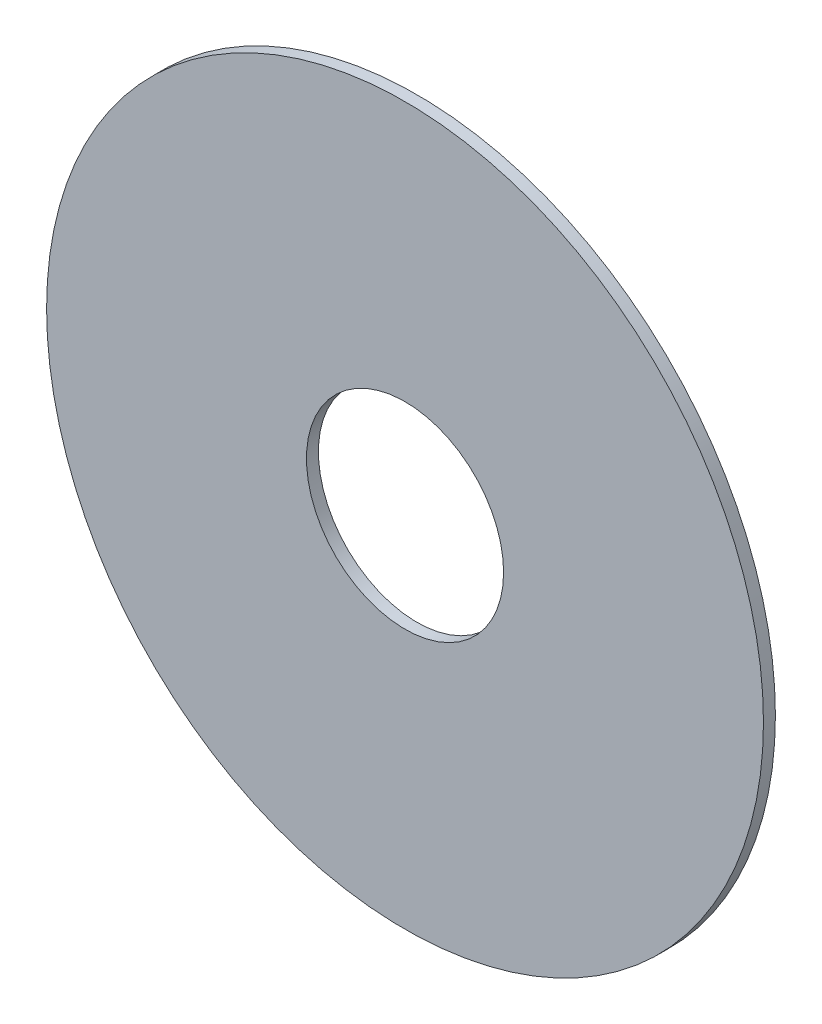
ISO-10303-21;
HEADER;
FILE_DESCRIPTION(('STEP AP214'),'2;1');
FILE_NAME('part.step','',(''),(''),'','','');
FILE_SCHEMA(('AUTOMOTIVE_DESIGN { 1 0 10303 214 1 1 1 1 }'));
ENDSEC;
DATA;
#1=APPLICATION_CONTEXT('core data for automotive mechanical design processes');
#2=APPLICATION_PROTOCOL_DEFINITION('international standard','automotive_design',2000,#1);
#3=PRODUCT_CONTEXT('',#1,'mechanical');
#4=PRODUCT('Part','Part','',(#3));
#5=PRODUCT_RELATED_PRODUCT_CATEGORY('part','',(#4));
#6=PRODUCT_DEFINITION_FORMATION('','',#4);
#7=PRODUCT_DEFINITION_CONTEXT('part definition',#1,'design');
#8=PRODUCT_DEFINITION('design','',#6,#7);
#9=PRODUCT_DEFINITION_SHAPE('','',#8);
#10=(LENGTH_UNIT() NAMED_UNIT(*) SI_UNIT(.MILLI.,.METRE.));
#11=(NAMED_UNIT(*) PLANE_ANGLE_UNIT() SI_UNIT($,.RADIAN.));
#12=(NAMED_UNIT(*) SI_UNIT($,.STERADIAN.) SOLID_ANGLE_UNIT());
#13=UNCERTAINTY_MEASURE_WITH_UNIT(LENGTH_MEASURE(1.E-05),#10,'distance_accuracy_value','');
#14=(GEOMETRIC_REPRESENTATION_CONTEXT(3) GLOBAL_UNCERTAINTY_ASSIGNED_CONTEXT((#13)) GLOBAL_UNIT_ASSIGNED_CONTEXT((#10,
#11,#12)) REPRESENTATION_CONTEXT('',''));
#15=CARTESIAN_POINT('',(0.,0.,0.));
#16=DIRECTION('',(0.,0.,1.));
#17=DIRECTION('',(1.,0.,0.));
#18=AXIS2_PLACEMENT_3D('',#15,#16,#17);
#19=CARTESIAN_POINT('',(0.,0.,1.));
#20=DIRECTION('',(0.,0.,1.));
#21=DIRECTION('',(1.,0.,0.));
#22=AXIS2_PLACEMENT_3D('',#19,#20,#21);
#23=PLANE('',#22);
#24=CARTESIAN_POINT('',(0.,0.,1.));
#25=DIRECTION('',(0.,0.,1.));
#26=DIRECTION('',(1.,0.,0.));
#27=AXIS2_PLACEMENT_3D('',#24,#25,#26);
#28=CIRCLE('',#27,30.);
#29=CARTESIAN_POINT('',(30.,0.,1.));
#30=VERTEX_POINT('',#29);
#31=EDGE_CURVE('E10',#30,#30,#28,.T.);
#32=ORIENTED_EDGE('',*,*,#31,.T.);
#33=EDGE_LOOP('',(#32));
#34=FACE_BOUND('',#33,.T.);
#35=CARTESIAN_POINT('',(0.,0.,1.));
#36=DIRECTION('',(0.,0.,1.));
#37=DIRECTION('',(1.,0.,0.));
#38=AXIS2_PLACEMENT_3D('',#35,#36,#37);
#39=CIRCLE('',#38,8.25);
#40=CARTESIAN_POINT('',(8.25,0.,1.));
#41=VERTEX_POINT('',#40);
#42=EDGE_CURVE('E45',#41,#41,#39,.T.);
#43=ORIENTED_EDGE('',*,*,#42,.F.);
#44=EDGE_LOOP('',(#43));
#45=FACE_BOUND('',#44,.T.);
#46=ADVANCED_FACE('F34',(#34,#45),#23,.T.);
#47=CARTESIAN_POINT('',(0.,0.,0.));
#48=DIRECTION('',(0.,0.,1.));
#49=DIRECTION('',(1.,0.,0.));
#50=AXIS2_PLACEMENT_3D('',#47,#48,#49);
#51=PLANE('',#50);
#52=CARTESIAN_POINT('',(0.,0.,0.));
#53=DIRECTION('',(0.,0.,1.));
#54=DIRECTION('',(1.,0.,0.));
#55=AXIS2_PLACEMENT_3D('',#52,#53,#54);
#56=CIRCLE('',#55,30.);
#57=CARTESIAN_POINT('',(30.,0.,0.));
#58=VERTEX_POINT('',#57);
#59=EDGE_CURVE('E41',#58,#58,#56,.T.);
#60=ORIENTED_EDGE('',*,*,#59,.F.);
#61=EDGE_LOOP('',(#60));
#62=FACE_BOUND('',#61,.T.);
#63=CARTESIAN_POINT('',(0.,0.,0.));
#64=DIRECTION('',(0.,0.,1.));
#65=DIRECTION('',(1.,0.,0.));
#66=AXIS2_PLACEMENT_3D('',#63,#64,#65);
#67=CIRCLE('',#66,8.25);
#68=CARTESIAN_POINT('',(8.25,0.,0.));
#69=VERTEX_POINT('',#68);
#70=EDGE_CURVE('E49',#69,#69,#67,.T.);
#71=ORIENTED_EDGE('',*,*,#70,.T.);
#72=EDGE_LOOP('',(#71));
#73=FACE_BOUND('',#72,.T.);
#74=ADVANCED_FACE('F55',(#62,#73),#51,.F.);
#75=CARTESIAN_POINT('',(0.,0.,1.));
#76=DIRECTION('',(0.,0.,-1.));
#77=DIRECTION('',(-1.,0.,0.));
#78=AXIS2_PLACEMENT_3D('',#75,#76,#77);
#79=CYLINDRICAL_SURFACE('',#78,30.);
#80=ORIENTED_EDGE('',*,*,#31,.F.);
#81=EDGE_LOOP('',(#80));
#82=FACE_BOUND('',#81,.T.);
#83=ORIENTED_EDGE('',*,*,#59,.T.);
#84=EDGE_LOOP('',(#83));
#85=FACE_BOUND('',#84,.T.);
#86=ADVANCED_FACE('F36',(#82,#85),#79,.T.);
#87=CARTESIAN_POINT('',(0.,0.,1.));
#88=DIRECTION('',(0.,0.,-1.));
#89=DIRECTION('',(-1.,0.,0.));
#90=AXIS2_PLACEMENT_3D('',#87,#88,#89);
#91=CYLINDRICAL_SURFACE('',#90,8.25);
#92=ORIENTED_EDGE('',*,*,#42,.T.);
#93=EDGE_LOOP('',(#92));
#94=FACE_BOUND('',#93,.T.);
#95=ORIENTED_EDGE('',*,*,#70,.F.);
#96=EDGE_LOOP('',(#95));
#97=FACE_BOUND('',#96,.T.);
#98=ADVANCED_FACE('F57',(#94,#97),#91,.F.);
#99=CLOSED_SHELL('',(#46,#74,#86,#98));
#100=MANIFOLD_SOLID_BREP('B2',#99);
#101=ADVANCED_BREP_SHAPE_REPRESENTATION('',(#18,#100),#14);
#102=SHAPE_DEFINITION_REPRESENTATION(#9,#101);
ENDSEC;
END-ISO-10303-21;
